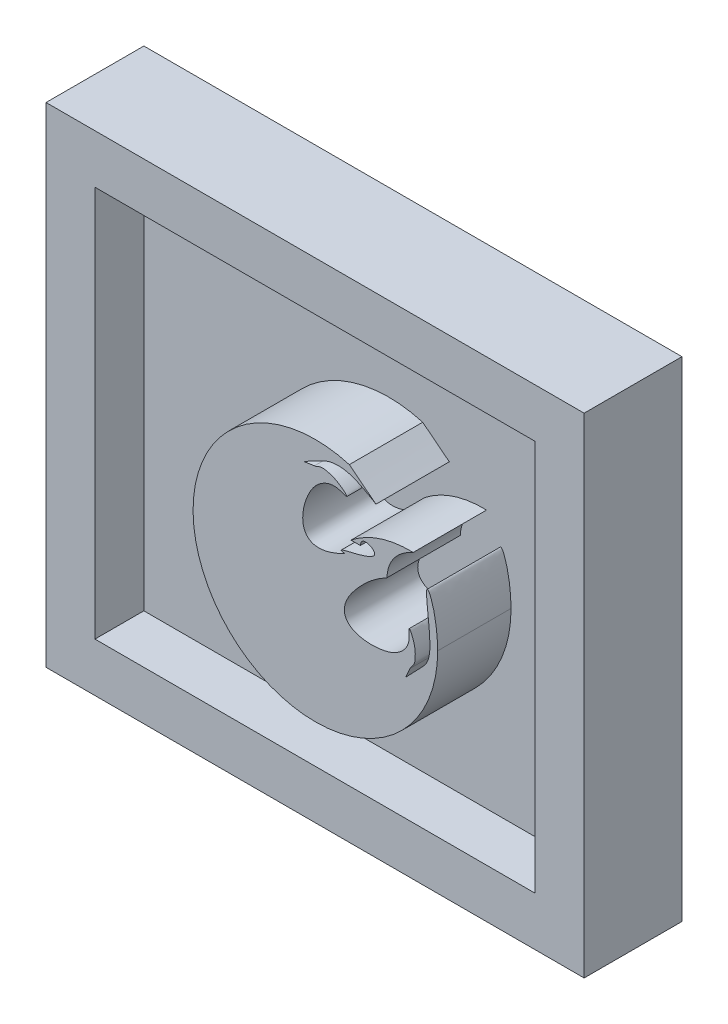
ISO-10303-21;
HEADER;
FILE_DESCRIPTION(('STEP AP214'),'2;1');
FILE_NAME('part.step','',(''),(''),'','','');
FILE_SCHEMA(('AUTOMOTIVE_DESIGN { 1 0 10303 214 1 1 1 1 }'));
ENDSEC;
DATA;
#1=APPLICATION_CONTEXT('core data for automotive mechanical design processes');
#2=APPLICATION_PROTOCOL_DEFINITION('international standard','automotive_design',2000,#1);
#3=PRODUCT_CONTEXT('',#1,'mechanical');
#4=PRODUCT('Part','Part','',(#3));
#5=PRODUCT_RELATED_PRODUCT_CATEGORY('part','',(#4));
#6=PRODUCT_DEFINITION_FORMATION('','',#4);
#7=PRODUCT_DEFINITION_CONTEXT('part definition',#1,'design');
#8=PRODUCT_DEFINITION('design','',#6,#7);
#9=PRODUCT_DEFINITION_SHAPE('','',#8);
#10=(LENGTH_UNIT() NAMED_UNIT(*) SI_UNIT(.MILLI.,.METRE.));
#11=(NAMED_UNIT(*) PLANE_ANGLE_UNIT() SI_UNIT($,.RADIAN.));
#12=(NAMED_UNIT(*) SI_UNIT($,.STERADIAN.) SOLID_ANGLE_UNIT());
#13=UNCERTAINTY_MEASURE_WITH_UNIT(LENGTH_MEASURE(1.E-05),#10,'distance_accuracy_value','');
#14=(GEOMETRIC_REPRESENTATION_CONTEXT(3) GLOBAL_UNCERTAINTY_ASSIGNED_CONTEXT((#13)) GLOBAL_UNIT_ASSIGNED_CONTEXT((#10,
#11,#12)) REPRESENTATION_CONTEXT('',''));
#15=CARTESIAN_POINT('',(0.,0.,0.));
#16=DIRECTION('',(0.,0.,1.));
#17=DIRECTION('',(1.,0.,0.));
#18=AXIS2_PLACEMENT_3D('',#15,#16,#17);
#19=CARTESIAN_POINT('',(23.1552065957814,-10.7258064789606,25.));
#20=DIRECTION('',(-0.907380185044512,0.420310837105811,0.));
#21=DIRECTION('',(-0.420310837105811,-0.907380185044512,0.));
#22=AXIS2_PLACEMENT_3D('',#19,#20,#21);
#23=PLANE('',#22);
#24=DIRECTION('',(0.420310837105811,0.907380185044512,0.));
#25=VECTOR('',#24,1.);
#26=CARTESIAN_POINT('',(23.1552065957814,-10.7258064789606,10.));
#27=LINE('',#26,#25);
#28=CARTESIAN_POINT('',(23.4716451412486,-10.0426690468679,10.));
#29=VERTEX_POINT('',#28);
#30=CARTESIAN_POINT('',(24.4319869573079,-7.96945308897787,10.));
#31=VERTEX_POINT('',#30);
#32=EDGE_CURVE('E306',#29,#31,#27,.T.);
#33=ORIENTED_EDGE('',*,*,#32,.T.);
#34=DIRECTION('',(0.,0.,-1.));
#35=VECTOR('',#34,1.);
#36=CARTESIAN_POINT('',(24.4319869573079,-7.96945308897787,25.));
#37=LINE('',#36,#35);
#38=CARTESIAN_POINT('',(24.4319869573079,-7.96945308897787,25.));
#39=VERTEX_POINT('',#38);
#40=EDGE_CURVE('E12',#39,#31,#37,.T.);
#41=ORIENTED_EDGE('',*,*,#40,.F.);
#42=DIRECTION('',(0.420310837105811,0.907380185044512,0.));
#43=VECTOR('',#42,1.);
#44=CARTESIAN_POINT('',(23.1552065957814,-10.7258064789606,25.));
#45=LINE('',#44,#43);
#46=CARTESIAN_POINT('',(23.4716451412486,-10.0426690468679,25.));
#47=VERTEX_POINT('',#46);
#48=EDGE_CURVE('E369',#47,#39,#45,.T.);
#49=ORIENTED_EDGE('',*,*,#48,.F.);
#50=DIRECTION('',(0.,0.,-1.));
#51=VECTOR('',#50,1.);
#52=CARTESIAN_POINT('',(23.4716451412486,-10.0426690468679,25.));
#53=LINE('',#52,#51);
#54=EDGE_CURVE('E171',#47,#29,#53,.T.);
#55=ORIENTED_EDGE('',*,*,#54,.T.);
#56=EDGE_LOOP('',(#33,#41,#49,#55));
#57=FACE_BOUND('',#56,.T.);
#58=ADVANCED_FACE('F43',(#57),#23,.F.);
#59=CARTESIAN_POINT('',(24.431986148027,-7.96945271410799,25.));
#60=CARTESIAN_POINT('',(24.4548308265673,-7.91052506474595,25.));
#61=CARTESIAN_POINT('',(24.6328157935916,-7.52650122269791,25.));
#62=CARTESIAN_POINT('',(25.3904822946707,-6.87081230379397,25.));
#63=CARTESIAN_POINT('',(25.5136110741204,-5.280999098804,25.));
#64=CARTESIAN_POINT('',(25.4164169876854,-3.10481522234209,25.));
#65=CARTESIAN_POINT('',(24.0577985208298,-0.138806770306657,25.));
#66=CARTESIAN_POINT('',(24.244122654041,-1.82535377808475,25.));
#67=CARTESIAN_POINT('',(24.2089781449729,-3.94139642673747,25.));
#68=CARTESIAN_POINT('',(22.4828493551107,-6.49207684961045,25.));
#69=CARTESIAN_POINT('',(15.4561380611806,-9.00171104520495,25.));
#70=CARTESIAN_POINT('',(6.94603593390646,-6.23824167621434,25.));
#71=CARTESIAN_POINT('',(14.2605783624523,1.49950282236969,25.));
#72=B_SPLINE_CURVE_WITH_KNOTS('',3,(#59,#60,#61,#62,#63,#64,#65,#66,#67,#68,#69,#70,#71),
.UNSPECIFIED.,.F.,.F.,(4,1,1,1,1,1,1,1,1,1,4),(0.337693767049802,0.341426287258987,
0.362746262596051,0.394756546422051,0.429544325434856,0.500578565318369,0.540544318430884,
0.562560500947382,0.621530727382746,0.71049127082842,1.),.UNSPECIFIED.);
#73=DIRECTION('',(0.,0.,-1.));
#74=VECTOR('',#73,1.);
#75=SURFACE_OF_LINEAR_EXTRUSION('',#72,#74);
#76=CARTESIAN_POINT('',(24.431986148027,-7.96945271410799,10.));
#77=CARTESIAN_POINT('',(24.4548308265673,-7.91052506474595,10.));
#78=CARTESIAN_POINT('',(24.6328157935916,-7.52650122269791,10.));
#79=CARTESIAN_POINT('',(25.3904822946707,-6.87081230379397,10.));
#80=CARTESIAN_POINT('',(25.5136110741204,-5.280999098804,10.));
#81=CARTESIAN_POINT('',(25.4164169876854,-3.10481522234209,10.));
#82=CARTESIAN_POINT('',(24.0577985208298,-0.138806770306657,10.));
#83=CARTESIAN_POINT('',(24.244122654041,-1.82535377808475,10.));
#84=CARTESIAN_POINT('',(24.2089781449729,-3.94139642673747,10.));
#85=CARTESIAN_POINT('',(22.4828493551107,-6.49207684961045,10.));
#86=CARTESIAN_POINT('',(15.4561380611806,-9.00171104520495,10.));
#87=CARTESIAN_POINT('',(6.94603593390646,-6.23824167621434,10.));
#88=CARTESIAN_POINT('',(14.2605783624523,1.49950282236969,10.));
#89=B_SPLINE_CURVE_WITH_KNOTS('',3,(#76,#77,#78,#79,#80,#81,#82,#83,#84,#85,#86,#87,#88),
.UNSPECIFIED.,.F.,.F.,(4,1,1,1,1,1,1,1,1,1,4),(0.337693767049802,0.341426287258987,
0.362746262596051,0.394756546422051,0.429544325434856,0.500578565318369,0.540544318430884,
0.562560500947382,0.621530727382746,0.71049127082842,1.),.UNSPECIFIED.);
#90=CARTESIAN_POINT('',(14.2605783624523,1.49950282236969,10.));
#91=VERTEX_POINT('',#90);
#92=EDGE_CURVE('E300',#31,#91,#89,.T.);
#93=ORIENTED_EDGE('',*,*,#92,.T.);
#94=DIRECTION('',(0.,0.,-1.));
#95=VECTOR('',#94,1.);
#96=CARTESIAN_POINT('',(14.2605783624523,1.49950282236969,25.));
#97=LINE('',#96,#95);
#98=CARTESIAN_POINT('',(14.2605783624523,1.49950282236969,25.));
#99=VERTEX_POINT('',#98);
#100=EDGE_CURVE('E51',#99,#91,#97,.T.);
#101=ORIENTED_EDGE('',*,*,#100,.F.);
#102=EDGE_CURVE('E120',#39,#99,#72,.T.);
#103=ORIENTED_EDGE('',*,*,#102,.F.);
#104=ORIENTED_EDGE('',*,*,#40,.T.);
#105=EDGE_LOOP('',(#93,#101,#103,#104));
#106=FACE_BOUND('',#105,.T.);
#107=ADVANCED_FACE('F301',(#106),#75,.F.);
#108=CARTESIAN_POINT('',(19.6827588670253,5.69554220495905,25.));
#109=CARTESIAN_POINT('',(16.6129724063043,4.07300333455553,25.));
#110=CARTESIAN_POINT('',(14.2605783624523,1.49950282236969,25.));
#111=B_SPLINE_CURVE_WITH_KNOTS('',2,(#108,#109,#110),.UNSPECIFIED.,.F.,.F.,(3,3),(0.,1.),.UNSPECIFIED.);
#112=DIRECTION('',(0.,0.,-1.));
#113=VECTOR('',#112,1.);
#114=SURFACE_OF_LINEAR_EXTRUSION('',#111,#113);
#115=CARTESIAN_POINT('',(19.6827588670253,5.69554220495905,10.));
#116=CARTESIAN_POINT('',(16.6129724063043,4.07300333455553,10.));
#117=CARTESIAN_POINT('',(14.2605783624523,1.49950282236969,10.));
#118=B_SPLINE_CURVE_WITH_KNOTS('',2,(#115,#116,#117),.UNSPECIFIED.,.F.,.F.,(3,3),(0.,1.),.UNSPECIFIED.);
#119=CARTESIAN_POINT('',(19.6827588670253,5.69554220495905,10.));
#120=VERTEX_POINT('',#119);
#121=EDGE_CURVE('E296',#120,#91,#118,.T.);
#122=ORIENTED_EDGE('',*,*,#121,.F.);
#123=DIRECTION('',(0.,0.,-1.));
#124=VECTOR('',#123,1.);
#125=CARTESIAN_POINT('',(19.6827588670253,5.69554220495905,25.));
#126=LINE('',#125,#124);
#127=CARTESIAN_POINT('',(19.6827588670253,5.69554220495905,25.));
#128=VERTEX_POINT('',#127);
#129=EDGE_CURVE('E289',#128,#120,#126,.T.);
#130=ORIENTED_EDGE('',*,*,#129,.F.);
#131=EDGE_CURVE('E299',#128,#99,#111,.T.);
#132=ORIENTED_EDGE('',*,*,#131,.T.);
#133=ORIENTED_EDGE('',*,*,#100,.T.);
#134=EDGE_LOOP('',(#122,#130,#132,#133));
#135=FACE_BOUND('',#134,.T.);
#136=ADVANCED_FACE('F294',(#135),#114,.T.);
#137=CARTESIAN_POINT('',(25.0579275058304,12.8756704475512,25.));
#138=CARTESIAN_POINT('',(19.9294118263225,10.5234648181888,25.));
#139=CARTESIAN_POINT('',(19.6827588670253,5.69554220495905,25.));
#140=B_SPLINE_CURVE_WITH_KNOTS('',2,(#137,#138,#139),.UNSPECIFIED.,.F.,.F.,(3,3),(0.,1.),.UNSPECIFIED.);
#141=DIRECTION('',(0.,0.,-1.));
#142=VECTOR('',#141,1.);
#143=SURFACE_OF_LINEAR_EXTRUSION('',#140,#142);
#144=CARTESIAN_POINT('',(25.0579275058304,12.8756704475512,10.));
#145=CARTESIAN_POINT('',(19.9294118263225,10.5234648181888,10.));
#146=CARTESIAN_POINT('',(19.6827588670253,5.69554220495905,10.));
#147=B_SPLINE_CURVE_WITH_KNOTS('',2,(#144,#145,#146),.UNSPECIFIED.,.F.,.F.,(3,3),(0.,1.),.UNSPECIFIED.);
#148=CARTESIAN_POINT('',(25.0579275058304,12.8756704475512,10.));
#149=VERTEX_POINT('',#148);
#150=EDGE_CURVE('E311',#149,#120,#147,.T.);
#151=ORIENTED_EDGE('',*,*,#150,.F.);
#152=DIRECTION('',(0.,0.,-1.));
#153=VECTOR('',#152,1.);
#154=CARTESIAN_POINT('',(25.0579275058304,12.8756704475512,25.));
#155=LINE('',#154,#153);
#156=CARTESIAN_POINT('',(25.0579275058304,12.8756704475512,25.));
#157=VERTEX_POINT('',#156);
#158=EDGE_CURVE('E287',#157,#149,#155,.T.);
#159=ORIENTED_EDGE('',*,*,#158,.F.);
#160=EDGE_CURVE('E249',#157,#128,#140,.T.);
#161=ORIENTED_EDGE('',*,*,#160,.T.);
#162=ORIENTED_EDGE('',*,*,#129,.T.);
#163=EDGE_LOOP('',(#151,#159,#161,#162));
#164=FACE_BOUND('',#163,.T.);
#165=ADVANCED_FACE('F240',(#164),#143,.T.);
#166=CARTESIAN_POINT('',(25.0579275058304,12.8756704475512,25.));
#167=CARTESIAN_POINT('',(17.8057406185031,13.029589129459,25.));
#168=CARTESIAN_POINT('',(12.3456336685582,8.69291244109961,25.));
#169=B_SPLINE_CURVE_WITH_KNOTS('',2,(#166,#167,#168),.UNSPECIFIED.,.F.,.F.,(3,3),(0.,1.),.UNSPECIFIED.);
#170=DIRECTION('',(0.,0.,-1.));
#171=VECTOR('',#170,1.);
#172=SURFACE_OF_LINEAR_EXTRUSION('',#169,#171);
#173=CARTESIAN_POINT('',(25.0579275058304,12.8756704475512,10.));
#174=CARTESIAN_POINT('',(17.8057406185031,13.029589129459,10.));
#175=CARTESIAN_POINT('',(12.3456336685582,8.69291244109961,10.));
#176=B_SPLINE_CURVE_WITH_KNOTS('',2,(#173,#174,#175),.UNSPECIFIED.,.F.,.F.,(3,3),(0.,1.),.UNSPECIFIED.);
#177=CARTESIAN_POINT('',(12.3456336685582,8.69291244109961,10.));
#178=VERTEX_POINT('',#177);
#179=EDGE_CURVE('E313',#149,#178,#176,.T.);
#180=ORIENTED_EDGE('',*,*,#179,.T.);
#181=DIRECTION('',(0.,0.,-1.));
#182=VECTOR('',#181,1.);
#183=CARTESIAN_POINT('',(12.3456336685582,8.69291244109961,25.));
#184=LINE('',#183,#182);
#185=CARTESIAN_POINT('',(12.3456336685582,8.69291244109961,25.));
#186=VERTEX_POINT('',#185);
#187=EDGE_CURVE('E284',#186,#178,#184,.T.);
#188=ORIENTED_EDGE('',*,*,#187,.F.);
#189=EDGE_CURVE('E244',#157,#186,#169,.T.);
#190=ORIENTED_EDGE('',*,*,#189,.F.);
#191=ORIENTED_EDGE('',*,*,#158,.T.);
#192=EDGE_LOOP('',(#180,#188,#190,#191));
#193=FACE_BOUND('',#192,.T.);
#194=ADVANCED_FACE('F235',(#193),#172,.F.);
#195=CARTESIAN_POINT('',(0.,8.69291244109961,25.));
#196=DIRECTION('',(0.,1.,0.));
#197=DIRECTION('',(0.,0.,1.));
#198=AXIS2_PLACEMENT_3D('',#195,#196,#197);
#199=PLANE('',#198);
#200=DIRECTION('',(1.,0.,0.));
#201=VECTOR('',#200,1.);
#202=CARTESIAN_POINT('',(0.,8.69291244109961,10.));
#203=LINE('',#202,#201);
#204=CARTESIAN_POINT('',(14.2605783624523,8.69291244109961,10.));
#205=VERTEX_POINT('',#204);
#206=EDGE_CURVE('E331',#178,#205,#203,.T.);
#207=ORIENTED_EDGE('',*,*,#206,.T.);
#208=DIRECTION('',(0.,0.,-1.));
#209=VECTOR('',#208,1.);
#210=CARTESIAN_POINT('',(14.2605783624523,8.69291244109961,25.));
#211=LINE('',#210,#209);
#212=CARTESIAN_POINT('',(14.2605783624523,8.69291244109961,25.));
#213=VERTEX_POINT('',#212);
#214=EDGE_CURVE('E270',#213,#205,#211,.T.);
#215=ORIENTED_EDGE('',*,*,#214,.F.);
#216=DIRECTION('',(1.,0.,0.));
#217=VECTOR('',#216,1.);
#218=CARTESIAN_POINT('',(0.,8.69291244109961,25.));
#219=LINE('',#218,#217);
#220=EDGE_CURVE('E248',#186,#213,#219,.T.);
#221=ORIENTED_EDGE('',*,*,#220,.F.);
#222=ORIENTED_EDGE('',*,*,#187,.T.);
#223=EDGE_LOOP('',(#207,#215,#221,#222));
#224=FACE_BOUND('',#223,.T.);
#225=ADVANCED_FACE('F231',(#224),#199,.F.);
#226=CARTESIAN_POINT('',(14.2605783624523,8.69291244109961,25.));
#227=CARTESIAN_POINT('',(14.3674877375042,10.7872750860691,25.));
#228=CARTESIAN_POINT('',(22.3909414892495,7.38923795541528,25.));
#229=CARTESIAN_POINT('',(7.53241860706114,6.02808366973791,25.));
#230=CARTESIAN_POINT('',(11.1135488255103,5.69554220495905,25.));
#231=B_SPLINE_CURVE_WITH_KNOTS('',3,(#226,#227,#228,#229,#230),.UNSPECIFIED.,.F.,.F.,(4,1,4),
(0.,0.343545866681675,1.),.UNSPECIFIED.);
#232=DIRECTION('',(0.,0.,-1.));
#233=VECTOR('',#232,1.);
#234=SURFACE_OF_LINEAR_EXTRUSION('',#231,#233);
#235=CARTESIAN_POINT('',(14.2605783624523,8.69291244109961,10.));
#236=CARTESIAN_POINT('',(14.3674877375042,10.7872750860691,10.));
#237=CARTESIAN_POINT('',(22.3909414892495,7.38923795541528,10.));
#238=CARTESIAN_POINT('',(7.53241860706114,6.02808366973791,10.));
#239=CARTESIAN_POINT('',(11.1135488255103,5.69554220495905,10.));
#240=B_SPLINE_CURVE_WITH_KNOTS('',3,(#235,#236,#237,#238,#239),.UNSPECIFIED.,.F.,.F.,(4,1,4),
(0.,0.343545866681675,1.),.UNSPECIFIED.);
#241=CARTESIAN_POINT('',(11.1135488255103,5.69554220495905,10.));
#242=VERTEX_POINT('',#241);
#243=EDGE_CURVE('E267',#205,#242,#240,.T.);
#244=ORIENTED_EDGE('',*,*,#243,.T.);
#245=DIRECTION('',(0.,0.,-1.));
#246=VECTOR('',#245,1.);
#247=CARTESIAN_POINT('',(11.1135488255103,5.69554220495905,25.));
#248=LINE('',#247,#246);
#249=CARTESIAN_POINT('',(11.1135488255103,5.69554220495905,25.));
#250=VERTEX_POINT('',#249);
#251=EDGE_CURVE('E265',#250,#242,#248,.T.);
#252=ORIENTED_EDGE('',*,*,#251,.F.);
#253=EDGE_CURVE('E214',#213,#250,#231,.T.);
#254=ORIENTED_EDGE('',*,*,#253,.F.);
#255=ORIENTED_EDGE('',*,*,#214,.T.);
#256=EDGE_LOOP('',(#244,#252,#254,#255));
#257=FACE_BOUND('',#256,.T.);
#258=ADVANCED_FACE('F227',(#257),#234,.F.);
#259=CARTESIAN_POINT('',(4.87134569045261,18.1114012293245,25.));
#260=CARTESIAN_POINT('',(4.93431274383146,18.1168323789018,25.));
#261=CARTESIAN_POINT('',(5.35281142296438,18.1801712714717,25.));
#262=CARTESIAN_POINT('',(6.1944194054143,18.7239382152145,25.));
#263=CARTESIAN_POINT('',(7.75511614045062,18.3969941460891,25.));
#264=CARTESIAN_POINT('',(9.81703831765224,17.6943563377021,25.));
#265=CARTESIAN_POINT('',(12.2839932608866,15.5596002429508,25.));
#266=CARTESIAN_POINT('',(10.7170788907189,16.2107045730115,25.));
#267=CARTESIAN_POINT('',(8.67583748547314,16.7694577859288,25.));
#268=CARTESIAN_POINT('',(5.74386821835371,15.8265646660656,25.));
#269=CARTESIAN_POINT('',(1.36714022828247,9.78361939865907,25.));
#270=CARTESIAN_POINT('',(1.63724222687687,0.840149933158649,25.));
#271=CARTESIAN_POINT('',(11.1135488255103,5.69554220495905,25.));
#272=B_SPLINE_CURVE_WITH_KNOTS('',3,(#259,#260,#261,#262,#263,#264,#265,#266,#267,#268,#269,
#270,#271),.UNSPECIFIED.,.F.,.F.,(4,1,1,1,1,1,1,1,1,1,4),(0.337693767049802,0.341426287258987,
0.362746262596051,0.394756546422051,0.429544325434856,0.500578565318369,0.540544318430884,
0.562560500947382,0.621530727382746,0.71049127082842,1.),.UNSPECIFIED.);
#273=DIRECTION('',(0.,0.,-1.));
#274=VECTOR('',#273,1.);
#275=SURFACE_OF_LINEAR_EXTRUSION('',#272,#274);
#276=CARTESIAN_POINT('',(4.87134569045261,18.1114012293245,10.));
#277=CARTESIAN_POINT('',(4.93431274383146,18.1168323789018,10.));
#278=CARTESIAN_POINT('',(5.35281142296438,18.1801712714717,10.));
#279=CARTESIAN_POINT('',(6.1944194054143,18.7239382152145,10.));
#280=CARTESIAN_POINT('',(7.75511614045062,18.3969941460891,10.));
#281=CARTESIAN_POINT('',(9.81703831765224,17.6943563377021,10.));
#282=CARTESIAN_POINT('',(12.2839932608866,15.5596002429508,10.));
#283=CARTESIAN_POINT('',(10.7170788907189,16.2107045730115,10.));
#284=CARTESIAN_POINT('',(8.67583748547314,16.7694577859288,10.));
#285=CARTESIAN_POINT('',(5.74386821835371,15.8265646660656,10.));
#286=CARTESIAN_POINT('',(1.36714022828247,9.78361939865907,10.));
#287=CARTESIAN_POINT('',(1.63724222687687,0.840149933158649,10.));
#288=CARTESIAN_POINT('',(11.1135488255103,5.69554220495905,10.));
#289=B_SPLINE_CURVE_WITH_KNOTS('',3,(#276,#277,#278,#279,#280,#281,#282,#283,#284,#285,#286,
#287,#288),.UNSPECIFIED.,.F.,.F.,(4,1,1,1,1,1,1,1,1,1,4),(0.337693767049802,0.341426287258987,
0.362746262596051,0.394756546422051,0.429544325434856,0.500578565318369,0.540544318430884,
0.562560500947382,0.621530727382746,0.71049127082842,1.),.UNSPECIFIED.);
#290=CARTESIAN_POINT('',(4.87134569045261,18.1114012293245,10.));
#291=VERTEX_POINT('',#290);
#292=EDGE_CURVE('E273',#291,#242,#289,.T.);
#293=ORIENTED_EDGE('',*,*,#292,.F.);
#294=DIRECTION('',(0.,0.,-1.));
#295=VECTOR('',#294,1.);
#296=CARTESIAN_POINT('',(4.87134569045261,18.1114012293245,25.));
#297=LINE('',#296,#295);
#298=CARTESIAN_POINT('',(4.87134569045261,18.1114012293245,25.));
#299=VERTEX_POINT('',#298);
#300=EDGE_CURVE('E271',#299,#291,#297,.T.);
#301=ORIENTED_EDGE('',*,*,#300,.F.);
#302=EDGE_CURVE('E208',#299,#250,#272,.T.);
#303=ORIENTED_EDGE('',*,*,#302,.T.);
#304=ORIENTED_EDGE('',*,*,#251,.T.);
#305=EDGE_LOOP('',(#293,#301,#303,#304));
#306=FACE_BOUND('',#305,.T.);
#307=ADVANCED_FACE('F223',(#306),#275,.T.);
#308=CARTESIAN_POINT('',(-2.56725765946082,16.9872138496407,25.));
#309=DIRECTION('',(-0.14943195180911,0.988772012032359,0.));
#310=DIRECTION('',(-0.988772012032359,-0.14943195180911,0.));
#311=AXIS2_PLACEMENT_3D('',#308,#309,#310);
#312=PLANE('',#311);
#313=DIRECTION('',(0.988772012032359,0.14943195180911,0.));
#314=VECTOR('',#313,1.);
#315=CARTESIAN_POINT('',(-2.56725765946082,16.9872138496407,10.));
#316=LINE('',#315,#314);
#317=CARTESIAN_POINT('',(2.61216340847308,17.7699736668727,10.));
#318=VERTEX_POINT('',#317);
#319=EDGE_CURVE('E345',#318,#291,#316,.T.);
#320=ORIENTED_EDGE('',*,*,#319,.F.);
#321=DIRECTION('',(0.,0.,-1.));
#322=VECTOR('',#321,1.);
#323=CARTESIAN_POINT('',(2.61216340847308,17.7699736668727,25.));
#324=LINE('',#323,#322);
#325=CARTESIAN_POINT('',(2.61216340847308,17.7699736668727,25.));
#326=VERTEX_POINT('',#325);
#327=EDGE_CURVE('E277',#326,#318,#324,.T.);
#328=ORIENTED_EDGE('',*,*,#327,.F.);
#329=DIRECTION('',(0.988772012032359,0.14943195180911,0.));
#330=VECTOR('',#329,1.);
#331=CARTESIAN_POINT('',(-2.56725765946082,16.9872138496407,25.));
#332=LINE('',#331,#330);
#333=EDGE_CURVE('E205',#326,#299,#332,.T.);
#334=ORIENTED_EDGE('',*,*,#333,.T.);
#335=ORIENTED_EDGE('',*,*,#300,.T.);
#336=EDGE_LOOP('',(#320,#328,#334,#335));
#337=FACE_BOUND('',#336,.T.);
#338=ADVANCED_FACE('F226',(#337),#312,.T.);
#339=CARTESIAN_POINT('',(-6.73880945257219,12.8760476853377,25.));
#340=DIRECTION('',(0.463694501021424,-0.885995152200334,0.));
#341=DIRECTION('',(0.885995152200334,0.463694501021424,0.));
#342=AXIS2_PLACEMENT_3D('',#339,#340,#341);
#343=PLANE('',#342);
#344=DIRECTION('',(-0.885995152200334,-0.463694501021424,0.));
#345=VECTOR('',#344,1.);
#346=CARTESIAN_POINT('',(-6.73880945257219,12.8760476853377,10.));
#347=LINE('',#346,#345);
#348=CARTESIAN_POINT('',(6.69987319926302,19.9093178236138,10.));
#349=VERTEX_POINT('',#348);
#350=EDGE_CURVE('E350',#349,#318,#347,.T.);
#351=ORIENTED_EDGE('',*,*,#350,.F.);
#352=DIRECTION('',(0.,0.,-1.));
#353=VECTOR('',#352,1.);
#354=CARTESIAN_POINT('',(6.69987319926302,19.9093178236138,25.));
#355=LINE('',#354,#353);
#356=CARTESIAN_POINT('',(6.69987319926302,19.9093178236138,25.));
#357=VERTEX_POINT('',#356);
#358=EDGE_CURVE('E279',#357,#349,#355,.T.);
#359=ORIENTED_EDGE('',*,*,#358,.F.);
#360=DIRECTION('',(-0.885995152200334,-0.463694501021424,0.));
#361=VECTOR('',#360,1.);
#362=CARTESIAN_POINT('',(-6.73880945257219,12.8760476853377,25.));
#363=LINE('',#362,#361);
#364=EDGE_CURVE('E199',#357,#326,#363,.T.);
#365=ORIENTED_EDGE('',*,*,#364,.T.);
#366=ORIENTED_EDGE('',*,*,#327,.T.);
#367=EDGE_LOOP('',(#351,#359,#365,#366));
#368=FACE_BOUND('',#367,.T.);
#369=ADVANCED_FACE('F192',(#368),#343,.T.);
#370=CARTESIAN_POINT('',(12.0015490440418,21.8920423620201,25.));
#371=CARTESIAN_POINT('',(21.9411000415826,13.8888065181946,25.));
#372=CARTESIAN_POINT('',(13.6106107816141,21.6959853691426,25.));
#373=CARTESIAN_POINT('',(7.8127867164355,20.463205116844,25.));
#374=CARTESIAN_POINT('',(6.69987319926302,19.9093178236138,25.));
#375=B_SPLINE_CURVE_WITH_KNOTS('',3,(#370,#371,#372,#373,#374),.UNSPECIFIED.,.F.,.F.,(4,1,4),
(0.,0.17443446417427,0.24880130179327),.UNSPECIFIED.);
#376=DIRECTION('',(0.,0.,-1.));
#377=VECTOR('',#376,1.);
#378=SURFACE_OF_LINEAR_EXTRUSION('',#375,#377);
#379=CARTESIAN_POINT('',(12.0015490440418,21.8920423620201,10.));
#380=CARTESIAN_POINT('',(21.9411000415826,13.8888065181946,10.));
#381=CARTESIAN_POINT('',(13.6106107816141,21.6959853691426,10.));
#382=CARTESIAN_POINT('',(7.8127867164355,20.463205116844,10.));
#383=CARTESIAN_POINT('',(6.69987319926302,19.9093178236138,10.));
#384=B_SPLINE_CURVE_WITH_KNOTS('',3,(#379,#380,#381,#382,#383),.UNSPECIFIED.,.F.,.F.,(4,1,4),
(0.,0.17443446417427,0.24880130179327),.UNSPECIFIED.);
#385=CARTESIAN_POINT('',(12.0015490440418,21.8920423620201,10.));
#386=VERTEX_POINT('',#385);
#387=EDGE_CURVE('E353',#386,#349,#384,.T.);
#388=ORIENTED_EDGE('',*,*,#387,.F.);
#389=DIRECTION('',(0.,0.,-1.));
#390=VECTOR('',#389,1.);
#391=CARTESIAN_POINT('',(12.0015490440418,21.8920423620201,25.));
#392=LINE('',#391,#390);
#393=CARTESIAN_POINT('',(12.0015490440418,21.8920423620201,25.));
#394=VERTEX_POINT('',#393);
#395=EDGE_CURVE('E166',#394,#386,#392,.T.);
#396=ORIENTED_EDGE('',*,*,#395,.F.);
#397=EDGE_CURVE('E159',#394,#357,#375,.T.);
#398=ORIENTED_EDGE('',*,*,#397,.T.);
#399=ORIENTED_EDGE('',*,*,#358,.T.);
#400=EDGE_LOOP('',(#388,#396,#398,#399));
#401=FACE_BOUND('',#400,.T.);
#402=ADVANCED_FACE('F189',(#401),#378,.T.);
#403=CARTESIAN_POINT('',(5.05792750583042,-2.12432955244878,25.));
#404=DIRECTION('',(0.,0.,-1.));
#405=DIRECTION('',(-1.,0.,0.));
#406=AXIS2_PLACEMENT_3D('',#403,#404,#405);
#407=CYLINDRICAL_SURFACE('',#406,25.);
#408=CARTESIAN_POINT('',(5.05792750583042,-2.12432955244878,10.));
#409=DIRECTION('',(0.,0.,1.));
#410=DIRECTION('',(1.,0.,0.));
#411=AXIS2_PLACEMENT_3D('',#408,#409,#410);
#412=CIRCLE('',#411,25.);
#413=CARTESIAN_POINT('',(30.0578195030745,-2.05084400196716,10.));
#414=VERTEX_POINT('',#413);
#415=EDGE_CURVE('E165',#386,#414,#412,.T.);
#416=ORIENTED_EDGE('',*,*,#415,.T.);
#417=DIRECTION('',(0.,0.,-1.));
#418=VECTOR('',#417,1.);
#419=CARTESIAN_POINT('',(30.0578195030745,-2.05084400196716,25.));
#420=LINE('',#419,#418);
#421=CARTESIAN_POINT('',(30.0578195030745,-2.05084400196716,25.));
#422=VERTEX_POINT('',#421);
#423=EDGE_CURVE('E162',#422,#414,#420,.T.);
#424=ORIENTED_EDGE('',*,*,#423,.F.);
#425=CARTESIAN_POINT('',(5.05792750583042,-2.12432955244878,25.));
#426=DIRECTION('',(0.,0.,1.));
#427=DIRECTION('',(1.,0.,0.));
#428=AXIS2_PLACEMENT_3D('',#425,#426,#427);
#429=CIRCLE('',#428,25.);
#430=EDGE_CURVE('E152',#394,#422,#429,.T.);
#431=ORIENTED_EDGE('',*,*,#430,.F.);
#432=ORIENTED_EDGE('',*,*,#395,.T.);
#433=EDGE_LOOP('',(#416,#424,#431,#432));
#434=FACE_BOUND('',#433,.T.);
#435=ADVANCED_FACE('F163',(#434),#407,.T.);
#436=CARTESIAN_POINT('',(30.0578195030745,-2.05084400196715,25.));
#437=CARTESIAN_POINT('',(30.0568724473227,-1.72865424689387,25.));
#438=CARTESIAN_POINT('',(29.9141780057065,4.43761341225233,25.));
#439=CARTESIAN_POINT('',(26.4804000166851,12.4966653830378,25.));
#440=CARTESIAN_POINT('',(29.4613142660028,-4.07329348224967,25.));
#441=CARTESIAN_POINT('',(27.5133218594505,-5.80417547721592,25.));
#442=CARTESIAN_POINT('',(26.6699742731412,-6.71748401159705,25.));
#443=B_SPLINE_CURVE_WITH_KNOTS('',3,(#436,#437,#438,#439,#440,#441,#442),.UNSPECIFIED.,.F.,.F.,
(4,1,1,1,4),(0.,0.0044043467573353,0.0880869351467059,0.17443446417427,0.24880130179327),.UNSPECIFIED.);
#444=DIRECTION('',(0.,0.,-1.));
#445=VECTOR('',#444,1.);
#446=SURFACE_OF_LINEAR_EXTRUSION('',#443,#445);
#447=CARTESIAN_POINT('',(30.0578195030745,-2.05084400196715,10.));
#448=CARTESIAN_POINT('',(30.0568724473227,-1.72865424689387,10.));
#449=CARTESIAN_POINT('',(29.9141780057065,4.43761341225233,10.));
#450=CARTESIAN_POINT('',(26.4804000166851,12.4966653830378,10.));
#451=CARTESIAN_POINT('',(29.4613142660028,-4.07329348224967,10.));
#452=CARTESIAN_POINT('',(27.5133218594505,-5.80417547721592,10.));
#453=CARTESIAN_POINT('',(26.6699742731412,-6.71748401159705,10.));
#454=B_SPLINE_CURVE_WITH_KNOTS('',3,(#447,#448,#449,#450,#451,#452,#453),.UNSPECIFIED.,.F.,.F.,
(4,1,1,1,4),(0.,0.0044043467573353,0.0880869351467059,0.17443446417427,0.24880130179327),.UNSPECIFIED.);
#455=CARTESIAN_POINT('',(26.6699742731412,-6.71748401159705,10.));
#456=VERTEX_POINT('',#455);
#457=EDGE_CURVE('E106',#414,#456,#454,.T.);
#458=ORIENTED_EDGE('',*,*,#457,.T.);
#459=DIRECTION('',(0.,0.,-1.));
#460=VECTOR('',#459,1.);
#461=CARTESIAN_POINT('',(26.6699742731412,-6.71748401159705,25.));
#462=LINE('',#461,#460);
#463=CARTESIAN_POINT('',(26.6699742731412,-6.71748401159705,25.));
#464=VERTEX_POINT('',#463);
#465=EDGE_CURVE('E167',#464,#456,#462,.T.);
#466=ORIENTED_EDGE('',*,*,#465,.F.);
#467=EDGE_CURVE('E156',#422,#464,#443,.T.);
#468=ORIENTED_EDGE('',*,*,#467,.F.);
#469=ORIENTED_EDGE('',*,*,#423,.T.);
#470=EDGE_LOOP('',(#458,#466,#468,#469));
#471=FACE_BOUND('',#470,.T.);
#472=ADVANCED_FACE('F169',(#471),#446,.F.);
#473=CARTESIAN_POINT('',(17.2096167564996,-16.5530693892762,25.));
#474=DIRECTION('',(0.72072088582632,-0.693225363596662,0.));
#475=DIRECTION('',(0.693225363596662,0.72072088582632,0.));
#476=AXIS2_PLACEMENT_3D('',#473,#474,#475);
#477=PLANE('',#476);
#478=DIRECTION('',(-0.693225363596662,-0.72072088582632,0.));
#479=VECTOR('',#478,1.);
#480=CARTESIAN_POINT('',(17.2096167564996,-16.5530693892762,10.));
#481=LINE('',#480,#479);
#482=EDGE_CURVE('E112',#456,#29,#481,.T.);
#483=ORIENTED_EDGE('',*,*,#482,.T.);
#484=ORIENTED_EDGE('',*,*,#54,.F.);
#485=DIRECTION('',(-0.693225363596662,-0.72072088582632,0.));
#486=VECTOR('',#485,1.);
#487=CARTESIAN_POINT('',(17.2096167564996,-16.5530693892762,25.));
#488=LINE('',#487,#486);
#489=EDGE_CURVE('E59',#464,#47,#488,.T.);
#490=ORIENTED_EDGE('',*,*,#489,.F.);
#491=ORIENTED_EDGE('',*,*,#465,.T.);
#492=EDGE_LOOP('',(#483,#484,#490,#491));
#493=FACE_BOUND('',#492,.T.);
#494=ADVANCED_FACE('F185',(#493),#477,.F.);
#495=CARTESIAN_POINT('',(0.,0.,25.));
#496=DIRECTION('',(0.,0.,1.));
#497=DIRECTION('',(1.,0.,0.));
#498=AXIS2_PLACEMENT_3D('',#495,#496,#497);
#499=PLANE('',#498);
#500=ORIENTED_EDGE('',*,*,#48,.T.);
#501=ORIENTED_EDGE('',*,*,#102,.T.);
#502=ORIENTED_EDGE('',*,*,#131,.F.);
#503=ORIENTED_EDGE('',*,*,#160,.F.);
#504=ORIENTED_EDGE('',*,*,#189,.T.);
#505=ORIENTED_EDGE('',*,*,#220,.T.);
#506=ORIENTED_EDGE('',*,*,#253,.T.);
#507=ORIENTED_EDGE('',*,*,#302,.F.);
#508=ORIENTED_EDGE('',*,*,#333,.F.);
#509=ORIENTED_EDGE('',*,*,#364,.F.);
#510=ORIENTED_EDGE('',*,*,#397,.F.);
#511=ORIENTED_EDGE('',*,*,#430,.T.);
#512=ORIENTED_EDGE('',*,*,#467,.T.);
#513=ORIENTED_EDGE('',*,*,#489,.T.);
#514=EDGE_LOOP('',(#500,#501,#502,#503,#504,#505,#506,#507,#508,#509,#510,#511,#512,#513));
#515=FACE_BOUND('',#514,.T.);
#516=ADVANCED_FACE('F154',(#515),#499,.T.);
#517=CARTESIAN_POINT('',(0.,0.,10.));
#518=DIRECTION('',(0.,0.,1.));
#519=DIRECTION('',(1.,0.,0.));
#520=AXIS2_PLACEMENT_3D('',#517,#518,#519);
#521=PLANE('',#520);
#522=ORIENTED_EDGE('',*,*,#32,.F.);
#523=ORIENTED_EDGE('',*,*,#482,.F.);
#524=ORIENTED_EDGE('',*,*,#457,.F.);
#525=ORIENTED_EDGE('',*,*,#415,.F.);
#526=ORIENTED_EDGE('',*,*,#387,.T.);
#527=ORIENTED_EDGE('',*,*,#350,.T.);
#528=ORIENTED_EDGE('',*,*,#319,.T.);
#529=ORIENTED_EDGE('',*,*,#292,.T.);
#530=ORIENTED_EDGE('',*,*,#243,.F.);
#531=ORIENTED_EDGE('',*,*,#206,.F.);
#532=ORIENTED_EDGE('',*,*,#179,.F.);
#533=ORIENTED_EDGE('',*,*,#150,.T.);
#534=ORIENTED_EDGE('',*,*,#121,.T.);
#535=ORIENTED_EDGE('',*,*,#92,.F.);
#536=EDGE_LOOP('',(#522,#523,#524,#525,#526,#527,#528,#529,#530,#531,#532,#533,#534,#535));
#537=FACE_BOUND('',#536,.T.);
#538=ADVANCED_FACE('F308',(#537),#521,.F.);
#539=CLOSED_SHELL('',(#58,#107,#136,#165,#194,#225,#258,#307,#338,#369,#402,#435,#472,#494,#516,#538));
#540=MANIFOLD_SOLID_BREP('B2',#539);
#541=CARTESIAN_POINT('',(0.,0.,20.));
#542=DIRECTION('',(0.,0.,-1.));
#543=DIRECTION('',(-1.,0.,0.));
#544=AXIS2_PLACEMENT_3D('',#541,#542,#543);
#545=PLANE('',#544);
#546=DIRECTION('',(0.,1.,0.));
#547=VECTOR('',#546,1.);
#548=CARTESIAN_POINT('',(55.,-50.,20.));
#549=LINE('',#548,#547);
#550=CARTESIAN_POINT('',(55.,-50.,20.));
#551=VERTEX_POINT('',#550);
#552=CARTESIAN_POINT('',(55.,50.,20.));
#553=VERTEX_POINT('',#552);
#554=EDGE_CURVE('E622',#551,#553,#549,.T.);
#555=ORIENTED_EDGE('',*,*,#554,.T.);
#556=DIRECTION('',(-1.,0.,0.));
#557=VECTOR('',#556,1.);
#558=CARTESIAN_POINT('',(-55.,50.,20.));
#559=LINE('',#558,#557);
#560=CARTESIAN_POINT('',(-55.,50.,20.));
#561=VERTEX_POINT('',#560);
#562=EDGE_CURVE('E566',#553,#561,#559,.T.);
#563=ORIENTED_EDGE('',*,*,#562,.T.);
#564=DIRECTION('',(0.,-1.,0.));
#565=VECTOR('',#564,1.);
#566=CARTESIAN_POINT('',(-55.,-50.,20.));
#567=LINE('',#566,#565);
#568=CARTESIAN_POINT('',(-55.,-50.,20.));
#569=VERTEX_POINT('',#568);
#570=EDGE_CURVE('E625',#561,#569,#567,.T.);
#571=ORIENTED_EDGE('',*,*,#570,.T.);
#572=DIRECTION('',(1.,0.,0.));
#573=VECTOR('',#572,1.);
#574=CARTESIAN_POINT('',(-55.,-50.,20.));
#575=LINE('',#574,#573);
#576=EDGE_CURVE('E538',#569,#551,#575,.T.);
#577=ORIENTED_EDGE('',*,*,#576,.T.);
#578=EDGE_LOOP('',(#555,#563,#571,#577));
#579=FACE_BOUND('',#578,.T.);
#580=DIRECTION('',(0.,1.,0.));
#581=VECTOR('',#580,1.);
#582=CARTESIAN_POINT('',(45.,0.,20.));
#583=LINE('',#582,#581);
#584=CARTESIAN_POINT('',(45.,-40.,20.));
#585=VERTEX_POINT('',#584);
#586=CARTESIAN_POINT('',(45.,40.,20.));
#587=VERTEX_POINT('',#586);
#588=EDGE_CURVE('E611',#585,#587,#583,.T.);
#589=ORIENTED_EDGE('',*,*,#588,.F.);
#590=DIRECTION('',(1.,0.,0.));
#591=VECTOR('',#590,1.);
#592=CARTESIAN_POINT('',(0.,-40.,20.));
#593=LINE('',#592,#591);
#594=CARTESIAN_POINT('',(-45.,-40.,20.));
#595=VERTEX_POINT('',#594);
#596=EDGE_CURVE('E620',#595,#585,#593,.T.);
#597=ORIENTED_EDGE('',*,*,#596,.F.);
#598=DIRECTION('',(0.,-1.,0.));
#599=VECTOR('',#598,1.);
#600=CARTESIAN_POINT('',(-45.,0.,20.));
#601=LINE('',#600,#599);
#602=CARTESIAN_POINT('',(-45.,40.,20.));
#603=VERTEX_POINT('',#602);
#604=EDGE_CURVE('E618',#603,#595,#601,.T.);
#605=ORIENTED_EDGE('',*,*,#604,.F.);
#606=DIRECTION('',(-1.,0.,0.));
#607=VECTOR('',#606,1.);
#608=CARTESIAN_POINT('',(0.,40.,20.));
#609=LINE('',#608,#607);
#610=EDGE_CURVE('E603',#587,#603,#609,.T.);
#611=ORIENTED_EDGE('',*,*,#610,.F.);
#612=EDGE_LOOP('',(#589,#597,#605,#611));
#613=FACE_BOUND('',#612,.T.);
#614=ADVANCED_FACE('F514',(#579,#613),#545,.F.);
#615=CARTESIAN_POINT('',(55.,-50.,20.));
#616=DIRECTION('',(-1.,0.,0.));
#617=DIRECTION('',(0.,0.,1.));
#618=AXIS2_PLACEMENT_3D('',#615,#616,#617);
#619=PLANE('',#618);
#620=DIRECTION('',(0.,1.,0.));
#621=VECTOR('',#620,1.);
#622=CARTESIAN_POINT('',(55.,-50.,0.));
#623=LINE('',#622,#621);
#624=CARTESIAN_POINT('',(55.,-50.,0.));
#625=VERTEX_POINT('',#624);
#626=CARTESIAN_POINT('',(55.,50.,0.));
#627=VERTEX_POINT('',#626);
#628=EDGE_CURVE('E629',#625,#627,#623,.T.);
#629=ORIENTED_EDGE('',*,*,#628,.T.);
#630=DIRECTION('',(0.,0.,-1.));
#631=VECTOR('',#630,1.);
#632=CARTESIAN_POINT('',(55.,50.,20.));
#633=LINE('',#632,#631);
#634=EDGE_CURVE('E41',#553,#627,#633,.T.);
#635=ORIENTED_EDGE('',*,*,#634,.F.);
#636=ORIENTED_EDGE('',*,*,#554,.F.);
#637=DIRECTION('',(0.,0.,-1.));
#638=VECTOR('',#637,1.);
#639=CARTESIAN_POINT('',(55.,-50.,20.));
#640=LINE('',#639,#638);
#641=EDGE_CURVE('E628',#551,#625,#640,.T.);
#642=ORIENTED_EDGE('',*,*,#641,.T.);
#643=EDGE_LOOP('',(#629,#635,#636,#642));
#644=FACE_BOUND('',#643,.T.);
#645=ADVANCED_FACE('F516',(#644),#619,.F.);
#646=CARTESIAN_POINT('',(-55.,50.,20.));
#647=DIRECTION('',(0.,-1.,0.));
#648=DIRECTION('',(0.,0.,-1.));
#649=AXIS2_PLACEMENT_3D('',#646,#647,#648);
#650=PLANE('',#649);
#651=DIRECTION('',(-1.,0.,0.));
#652=VECTOR('',#651,1.);
#653=CARTESIAN_POINT('',(-55.,50.,0.));
#654=LINE('',#653,#652);
#655=CARTESIAN_POINT('',(-55.,50.,0.));
#656=VERTEX_POINT('',#655);
#657=EDGE_CURVE('E632',#627,#656,#654,.T.);
#658=ORIENTED_EDGE('',*,*,#657,.T.);
#659=DIRECTION('',(0.,0.,-1.));
#660=VECTOR('',#659,1.);
#661=CARTESIAN_POINT('',(-55.,50.,20.));
#662=LINE('',#661,#660);
#663=EDGE_CURVE('E522',#561,#656,#662,.T.);
#664=ORIENTED_EDGE('',*,*,#663,.F.);
#665=ORIENTED_EDGE('',*,*,#562,.F.);
#666=ORIENTED_EDGE('',*,*,#634,.T.);
#667=EDGE_LOOP('',(#658,#664,#665,#666));
#668=FACE_BOUND('',#667,.T.);
#669=ADVANCED_FACE('F660',(#668),#650,.F.);
#670=CARTESIAN_POINT('',(-55.,-50.,20.));
#671=DIRECTION('',(1.,0.,0.));
#672=DIRECTION('',(0.,0.,-1.));
#673=AXIS2_PLACEMENT_3D('',#670,#671,#672);
#674=PLANE('',#673);
#675=DIRECTION('',(0.,-1.,0.));
#676=VECTOR('',#675,1.);
#677=CARTESIAN_POINT('',(-55.,-50.,0.));
#678=LINE('',#677,#676);
#679=CARTESIAN_POINT('',(-55.,-50.,0.));
#680=VERTEX_POINT('',#679);
#681=EDGE_CURVE('E634',#656,#680,#678,.T.);
#682=ORIENTED_EDGE('',*,*,#681,.T.);
#683=DIRECTION('',(0.,0.,-1.));
#684=VECTOR('',#683,1.);
#685=CARTESIAN_POINT('',(-55.,-50.,20.));
#686=LINE('',#685,#684);
#687=EDGE_CURVE('E638',#569,#680,#686,.T.);
#688=ORIENTED_EDGE('',*,*,#687,.F.);
#689=ORIENTED_EDGE('',*,*,#570,.F.);
#690=ORIENTED_EDGE('',*,*,#663,.T.);
#691=EDGE_LOOP('',(#682,#688,#689,#690));
#692=FACE_BOUND('',#691,.T.);
#693=ADVANCED_FACE('F643',(#692),#674,.F.);
#694=CARTESIAN_POINT('',(-55.,-50.,20.));
#695=DIRECTION('',(0.,1.,0.));
#696=DIRECTION('',(0.,0.,1.));
#697=AXIS2_PLACEMENT_3D('',#694,#695,#696);
#698=PLANE('',#697);
#699=DIRECTION('',(1.,0.,0.));
#700=VECTOR('',#699,1.);
#701=CARTESIAN_POINT('',(-55.,-50.,0.));
#702=LINE('',#701,#700);
#703=EDGE_CURVE('E559',#680,#625,#702,.T.);
#704=ORIENTED_EDGE('',*,*,#703,.T.);
#705=ORIENTED_EDGE('',*,*,#641,.F.);
#706=ORIENTED_EDGE('',*,*,#576,.F.);
#707=ORIENTED_EDGE('',*,*,#687,.T.);
#708=EDGE_LOOP('',(#704,#705,#706,#707));
#709=FACE_BOUND('',#708,.T.);
#710=ADVANCED_FACE('F651',(#709),#698,.F.);
#711=CARTESIAN_POINT('',(0.,0.,0.));
#712=DIRECTION('',(0.,0.,-1.));
#713=DIRECTION('',(-1.,0.,0.));
#714=AXIS2_PLACEMENT_3D('',#711,#712,#713);
#715=PLANE('',#714);
#716=ORIENTED_EDGE('',*,*,#628,.F.);
#717=ORIENTED_EDGE('',*,*,#703,.F.);
#718=ORIENTED_EDGE('',*,*,#681,.F.);
#719=ORIENTED_EDGE('',*,*,#657,.F.);
#720=EDGE_LOOP('',(#716,#717,#718,#719));
#721=FACE_BOUND('',#720,.T.);
#722=ADVANCED_FACE('F647',(#721),#715,.T.);
#723=CARTESIAN_POINT('',(45.,-50.,20.));
#724=DIRECTION('',(-1.,0.,0.));
#725=DIRECTION('',(0.,0.,1.));
#726=AXIS2_PLACEMENT_3D('',#723,#724,#725);
#727=PLANE('',#726);
#728=DIRECTION('',(0.,1.,0.));
#729=VECTOR('',#728,1.);
#730=CARTESIAN_POINT('',(45.,0.,10.));
#731=LINE('',#730,#729);
#732=CARTESIAN_POINT('',(45.,-40.,10.));
#733=VERTEX_POINT('',#732);
#734=CARTESIAN_POINT('',(45.,40.,10.));
#735=VERTEX_POINT('',#734);
#736=EDGE_CURVE('E594',#733,#735,#731,.T.);
#737=ORIENTED_EDGE('',*,*,#736,.F.);
#738=DIRECTION('',(0.,0.,-1.));
#739=VECTOR('',#738,1.);
#740=CARTESIAN_POINT('',(45.,-40.,20.));
#741=LINE('',#740,#739);
#742=EDGE_CURVE('E614',#585,#733,#741,.T.);
#743=ORIENTED_EDGE('',*,*,#742,.F.);
#744=ORIENTED_EDGE('',*,*,#588,.T.);
#745=DIRECTION('',(0.,0.,-1.));
#746=VECTOR('',#745,1.);
#747=CARTESIAN_POINT('',(45.,40.,20.));
#748=LINE('',#747,#746);
#749=EDGE_CURVE('E606',#587,#735,#748,.T.);
#750=ORIENTED_EDGE('',*,*,#749,.T.);
#751=EDGE_LOOP('',(#737,#743,#744,#750));
#752=FACE_BOUND('',#751,.T.);
#753=ADVANCED_FACE('F658',(#752),#727,.T.);
#754=CARTESIAN_POINT('',(-55.,40.,20.));
#755=DIRECTION('',(0.,-1.,0.));
#756=DIRECTION('',(0.,0.,-1.));
#757=AXIS2_PLACEMENT_3D('',#754,#755,#756);
#758=PLANE('',#757);
#759=DIRECTION('',(-1.,0.,0.));
#760=VECTOR('',#759,1.);
#761=CARTESIAN_POINT('',(0.,40.,10.));
#762=LINE('',#761,#760);
#763=CARTESIAN_POINT('',(-45.,40.,10.));
#764=VERTEX_POINT('',#763);
#765=EDGE_CURVE('E588',#735,#764,#762,.T.);
#766=ORIENTED_EDGE('',*,*,#765,.F.);
#767=ORIENTED_EDGE('',*,*,#749,.F.);
#768=ORIENTED_EDGE('',*,*,#610,.T.);
#769=DIRECTION('',(0.,0.,-1.));
#770=VECTOR('',#769,1.);
#771=CARTESIAN_POINT('',(-45.,40.,20.));
#772=LINE('',#771,#770);
#773=EDGE_CURVE('E600',#603,#764,#772,.T.);
#774=ORIENTED_EDGE('',*,*,#773,.T.);
#775=EDGE_LOOP('',(#766,#767,#768,#774));
#776=FACE_BOUND('',#775,.T.);
#777=ADVANCED_FACE('F601',(#776),#758,.T.);
#778=CARTESIAN_POINT('',(-45.,-50.,20.));
#779=DIRECTION('',(1.,0.,0.));
#780=DIRECTION('',(0.,0.,-1.));
#781=AXIS2_PLACEMENT_3D('',#778,#779,#780);
#782=PLANE('',#781);
#783=DIRECTION('',(0.,-1.,0.));
#784=VECTOR('',#783,1.);
#785=CARTESIAN_POINT('',(-45.,0.,10.));
#786=LINE('',#785,#784);
#787=CARTESIAN_POINT('',(-45.,-40.,10.));
#788=VERTEX_POINT('',#787);
#789=EDGE_CURVE('E592',#764,#788,#786,.T.);
#790=ORIENTED_EDGE('',*,*,#789,.F.);
#791=ORIENTED_EDGE('',*,*,#773,.F.);
#792=ORIENTED_EDGE('',*,*,#604,.T.);
#793=DIRECTION('',(0.,0.,-1.));
#794=VECTOR('',#793,1.);
#795=CARTESIAN_POINT('',(-45.,-40.,20.));
#796=LINE('',#795,#794);
#797=EDGE_CURVE('E529',#595,#788,#796,.T.);
#798=ORIENTED_EDGE('',*,*,#797,.T.);
#799=EDGE_LOOP('',(#790,#791,#792,#798));
#800=FACE_BOUND('',#799,.T.);
#801=ADVANCED_FACE('F608',(#800),#782,.T.);
#802=CARTESIAN_POINT('',(-55.,-40.,20.));
#803=DIRECTION('',(0.,1.,0.));
#804=DIRECTION('',(0.,0.,1.));
#805=AXIS2_PLACEMENT_3D('',#802,#803,#804);
#806=PLANE('',#805);
#807=DIRECTION('',(1.,0.,0.));
#808=VECTOR('',#807,1.);
#809=CARTESIAN_POINT('',(0.,-40.,10.));
#810=LINE('',#809,#808);
#811=EDGE_CURVE('E609',#788,#733,#810,.T.);
#812=ORIENTED_EDGE('',*,*,#811,.F.);
#813=ORIENTED_EDGE('',*,*,#797,.F.);
#814=ORIENTED_EDGE('',*,*,#596,.T.);
#815=ORIENTED_EDGE('',*,*,#742,.T.);
#816=EDGE_LOOP('',(#812,#813,#814,#815));
#817=FACE_BOUND('',#816,.T.);
#818=ADVANCED_FACE('F671',(#817),#806,.T.);
#819=CARTESIAN_POINT('',(0.,0.,10.));
#820=DIRECTION('',(0.,0.,-1.));
#821=DIRECTION('',(-1.,0.,0.));
#822=AXIS2_PLACEMENT_3D('',#819,#820,#821);
#823=PLANE('',#822);
#824=ORIENTED_EDGE('',*,*,#736,.T.);
#825=ORIENTED_EDGE('',*,*,#765,.T.);
#826=ORIENTED_EDGE('',*,*,#789,.T.);
#827=ORIENTED_EDGE('',*,*,#811,.T.);
#828=EDGE_LOOP('',(#824,#825,#826,#827));
#829=FACE_BOUND('',#828,.T.);
#830=ADVANCED_FACE('F590',(#829),#823,.F.);
#831=CLOSED_SHELL('',(#614,#645,#669,#693,#710,#722,#753,#777,#801,#818,#830));
#832=MANIFOLD_SOLID_BREP('B6',#831);
#833=ADVANCED_BREP_SHAPE_REPRESENTATION('',(#18,#540,#832),#14);
#834=SHAPE_DEFINITION_REPRESENTATION(#9,#833);
ENDSEC;
END-ISO-10303-21;
